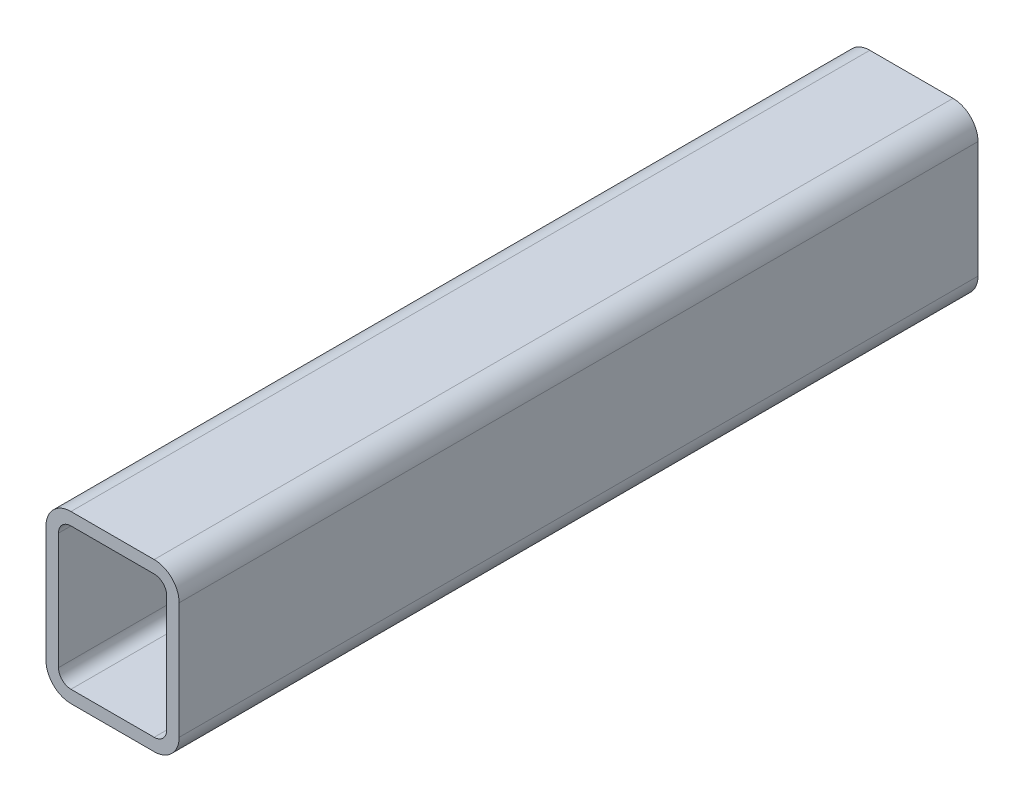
from build123d import *

# Parameters (mm, degrees)
BOSS_EXTRUDE1_DEPTH = 304.8


with BuildPart() as part:
    # Sketch1 → Boss-Extrude1 (new body)
    with BuildSketch(Plane.XY):
        with BuildLine():
            Line((50.8, 53.975), (50.8, 9.525))
            ThreePointArc((50.8, 9.525), (48.010192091, 2.789807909), (41.275, 0))
            Line((41.275, 0), (9.525, 0))
            ThreePointArc((9.525, 0), (2.789807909, 2.789807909), (0, 9.525))
            Line((0, 9.525), (0, 53.975))
            ThreePointArc((0, 53.975), (2.789807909, 60.710192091), (9.525, 63.5))
            Line((9.525, 63.5), (41.275, 63.5))
            ThreePointArc((41.275, 63.5), (48.010192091, 60.710192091), (50.8, 53.975))
        make_face()
        with BuildLine():
            Line((9.525, 58.7375), (41.275, 58.7375))
            ThreePointArc((41.275, 58.7375), (44.642596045, 57.342596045), (46.0375, 53.975))
            Line((46.0375, 53.975), (46.0375, 9.525))
            ThreePointArc((46.0375, 9.525), (44.642596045, 6.157403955), (41.275, 4.7625))
            Line((41.275, 4.7625), (9.525, 4.7625))
            ThreePointArc((9.525, 4.7625), (6.157403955, 6.157403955), (4.7625, 9.525))
            Line((4.7625, 9.525), (4.7625, 53.975))
            ThreePointArc((4.7625, 53.975), (6.157403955, 57.342596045), (9.525, 58.7375))
        make_face(mode=Mode.SUBTRACT)
    extrude(amount=BOSS_EXTRUDE1_DEPTH)


solid = part.part
